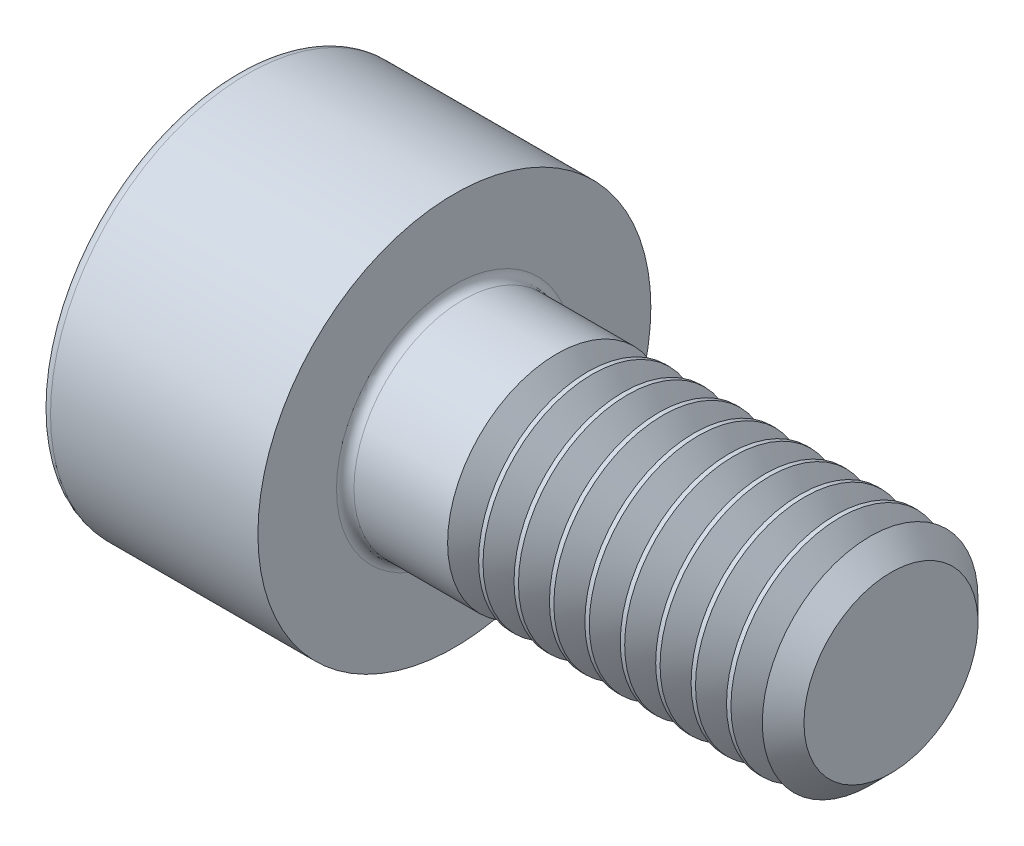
ISO-10303-21;
HEADER;
FILE_DESCRIPTION(('STEP AP214'),'2;1');
FILE_NAME('part.step','',(''),(''),'','','');
FILE_SCHEMA(('AUTOMOTIVE_DESIGN { 1 0 10303 214 1 1 1 1 }'));
ENDSEC;
DATA;
#1=APPLICATION_CONTEXT('core data for automotive mechanical design processes');
#2=APPLICATION_PROTOCOL_DEFINITION('international standard','automotive_design',2000,#1);
#3=PRODUCT_CONTEXT('',#1,'mechanical');
#4=PRODUCT('Part','Part','',(#3));
#5=PRODUCT_RELATED_PRODUCT_CATEGORY('part','',(#4));
#6=PRODUCT_DEFINITION_FORMATION('','',#4);
#7=PRODUCT_DEFINITION_CONTEXT('part definition',#1,'design');
#8=PRODUCT_DEFINITION('design','',#6,#7);
#9=PRODUCT_DEFINITION_SHAPE('','',#8);
#10=(LENGTH_UNIT() NAMED_UNIT(*) SI_UNIT(.MILLI.,.METRE.));
#11=(NAMED_UNIT(*) PLANE_ANGLE_UNIT() SI_UNIT($,.RADIAN.));
#12=(NAMED_UNIT(*) SI_UNIT($,.STERADIAN.) SOLID_ANGLE_UNIT());
#13=UNCERTAINTY_MEASURE_WITH_UNIT(LENGTH_MEASURE(1.E-05),#10,'distance_accuracy_value','');
#14=(GEOMETRIC_REPRESENTATION_CONTEXT(3) GLOBAL_UNCERTAINTY_ASSIGNED_CONTEXT((#13)) GLOBAL_UNIT_ASSIGNED_CONTEXT((#10,
#11,#12)) REPRESENTATION_CONTEXT('',''));
#15=CARTESIAN_POINT('',(0.,0.,0.));
#16=DIRECTION('',(0.,0.,1.));
#17=DIRECTION('',(1.,0.,0.));
#18=AXIS2_PLACEMENT_3D('',#15,#16,#17);
#19=CARTESIAN_POINT('',(0.,0.,1.94722710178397E-13));
#20=DIRECTION('',(-1.,0.,0.));
#21=DIRECTION('',(0.,0.,1.));
#22=AXIS2_PLACEMENT_3D('',#19,#20,#21);
#23=PLANE('',#22);
#24=DIRECTION('',(0.,-0.499999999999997,0.866025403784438));
#25=VECTOR('',#24,1.);
#26=CARTESIAN_POINT('',(0.,1.18068130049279,0.));
#27=LINE('',#26,#25);
#28=CARTESIAN_POINT('',(0.,1.18068130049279,0.));
#29=VERTEX_POINT('',#28);
#30=CARTESIAN_POINT('',(0.,0.59034065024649,1.02250000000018));
#31=VERTEX_POINT('',#30);
#32=EDGE_CURVE('E121',#29,#31,#27,.T.);
#33=ORIENTED_EDGE('',*,*,#32,.T.);
#34=DIRECTION('',(0.,0.999999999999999,0.));
#35=VECTOR('',#34,1.);
#36=CARTESIAN_POINT('',(-1.11022302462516E-13,-0.590340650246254,1.02250000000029));
#37=LINE('',#36,#35);
#38=CARTESIAN_POINT('',(-1.11022302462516E-13,-0.590340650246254,1.02250000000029));
#39=VERTEX_POINT('',#38);
#40=EDGE_CURVE('E110',#39,#31,#37,.T.);
#41=ORIENTED_EDGE('',*,*,#40,.F.);
#42=DIRECTION('',(0.,-0.500000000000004,-0.866025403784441));
#43=VECTOR('',#42,1.);
#44=CARTESIAN_POINT('',(-1.11022302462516E-13,-0.590340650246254,1.02250000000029));
#45=LINE('',#44,#43);
#46=CARTESIAN_POINT('',(0.,-1.1806813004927,3.6125616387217E-13));
#47=VERTEX_POINT('',#46);
#48=EDGE_CURVE('E120',#39,#47,#45,.T.);
#49=ORIENTED_EDGE('',*,*,#48,.T.);
#50=DIRECTION('',(0.,0.499999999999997,-0.866025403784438));
#51=VECTOR('',#50,1.);
#52=CARTESIAN_POINT('',(0.,-1.1806813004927,3.6125616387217E-13));
#53=LINE('',#52,#51);
#54=CARTESIAN_POINT('',(0.,-0.590340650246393,-1.02249999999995));
#55=VERTEX_POINT('',#54);
#56=EDGE_CURVE('E144',#47,#55,#53,.T.);
#57=ORIENTED_EDGE('',*,*,#56,.T.);
#58=DIRECTION('',(0.,-0.999999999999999,0.));
#59=VECTOR('',#58,1.);
#60=CARTESIAN_POINT('',(0.,0.590340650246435,-1.02249999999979));
#61=LINE('',#60,#59);
#62=CARTESIAN_POINT('',(0.,0.590340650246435,-1.02249999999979));
#63=VERTEX_POINT('',#62);
#64=EDGE_CURVE('E147',#63,#55,#61,.T.);
#65=ORIENTED_EDGE('',*,*,#64,.F.);
#66=DIRECTION('',(0.,-0.500000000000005,-0.866025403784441));
#67=VECTOR('',#66,1.);
#68=CARTESIAN_POINT('',(0.,1.18068130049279,0.));
#69=LINE('',#68,#67);
#70=EDGE_CURVE('E135',#29,#63,#69,.T.);
#71=ORIENTED_EDGE('',*,*,#70,.F.);
#72=EDGE_LOOP('',(#33,#41,#49,#57,#65,#71));
#73=FACE_BOUND('',#72,.T.);
#74=CARTESIAN_POINT('',(0.,0.,1.94722710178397E-13));
#75=DIRECTION('',(-1.,0.,0.));
#76=DIRECTION('',(0.,0.,1.));
#77=AXIS2_PLACEMENT_3D('',#74,#75,#76);
#78=CIRCLE('',#77,2.125);
#79=CARTESIAN_POINT('',(0.,0.,2.1250000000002));
#80=VERTEX_POINT('',#79);
#81=EDGE_CURVE('E46',#80,#80,#78,.T.);
#82=ORIENTED_EDGE('',*,*,#81,.T.);
#83=EDGE_LOOP('',(#82));
#84=FACE_BOUND('',#83,.T.);
#85=ADVANCED_FACE('F38',(#73,#84),#23,.T.);
#86=CARTESIAN_POINT('',(-31.7500000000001,0.,4.44089209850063E-13));
#87=DIRECTION('',(-1.,0.,0.));
#88=DIRECTION('',(0.,0.,1.));
#89=AXIS2_PLACEMENT_3D('',#86,#87,#88);
#90=CYLINDRICAL_SURFACE('',#89,2.25);
#91=CARTESIAN_POINT('',(0.124999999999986,1.11022302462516E-13,2.22478285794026E-13));
#92=DIRECTION('',(-1.,0.,0.));
#93=DIRECTION('',(0.,0.,1.));
#94=AXIS2_PLACEMENT_3D('',#91,#92,#93);
#95=CIRCLE('',#94,2.25);
#96=CARTESIAN_POINT('',(0.124999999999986,1.17403794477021E-13,2.25000000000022));
#97=VERTEX_POINT('',#96);
#98=EDGE_CURVE('E11',#97,#97,#95,.F.);
#99=ORIENTED_EDGE('',*,*,#98,.T.);
#100=EDGE_LOOP('',(#99));
#101=FACE_BOUND('',#100,.T.);
#102=CARTESIAN_POINT('',(2.50000000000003,0.,2.77555756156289E-13));
#103=DIRECTION('',(-1.,0.,0.));
#104=DIRECTION('',(0.,0.,1.));
#105=AXIS2_PLACEMENT_3D('',#102,#103,#104);
#106=CIRCLE('',#105,2.25);
#107=CARTESIAN_POINT('',(2.50000000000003,1.03526006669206E-13,2.25000000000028));
#108=VERTEX_POINT('',#107);
#109=EDGE_CURVE('E189',#108,#108,#106,.T.);
#110=ORIENTED_EDGE('',*,*,#109,.T.);
#111=EDGE_LOOP('',(#110));
#112=FACE_BOUND('',#111,.T.);
#113=ADVANCED_FACE('F217',(#101,#112),#90,.T.);
#114=CARTESIAN_POINT('',(2.49999999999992,2.25000000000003,0.));
#115=DIRECTION('',(1.,0.,0.));
#116=DIRECTION('',(0.,0.,-1.));
#117=AXIS2_PLACEMENT_3D('',#114,#115,#116);
#118=PLANE('',#117);
#119=CARTESIAN_POINT('',(2.50000000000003,0.,2.77555756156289E-13));
#120=DIRECTION('',(1.,0.,0.));
#121=DIRECTION('',(0.,0.,-1.));
#122=AXIS2_PLACEMENT_3D('',#119,#120,#121);
#123=CIRCLE('',#122,1.35);
#124=CARTESIAN_POINT('',(2.50000000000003,0.,-1.34999999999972));
#125=VERTEX_POINT('',#124);
#126=EDGE_CURVE('E192',#125,#125,#123,.F.);
#127=ORIENTED_EDGE('',*,*,#126,.T.);
#128=EDGE_LOOP('',(#127));
#129=FACE_BOUND('',#128,.T.);
#130=ORIENTED_EDGE('',*,*,#109,.F.);
#131=EDGE_LOOP('',(#130));
#132=FACE_BOUND('',#131,.T.);
#133=ADVANCED_FACE('F221',(#129,#132),#118,.T.);
#134=CARTESIAN_POINT('',(-31.7500000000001,0.,4.44089209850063E-13));
#135=DIRECTION('',(-1.,0.,0.));
#136=DIRECTION('',(0.,0.,1.));
#137=AXIS2_PLACEMENT_3D('',#134,#135,#136);
#138=CYLINDRICAL_SURFACE('',#137,1.25);
#139=CARTESIAN_POINT('',(3.67249738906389,1.52655665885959E-13,3.89011739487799E-13));
#140=DIRECTION('',(-1.,0.,0.));
#141=DIRECTION('',(0.,-0.999999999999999,0.));
#142=AXIS2_PLACEMENT_3D('',#139,#140,#141);
#143=CIRCLE('',#142,1.25);
#144=CARTESIAN_POINT('',(3.67249738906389,-1.24999999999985,3.84925991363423E-13));
#145=VERTEX_POINT('',#144);
#146=EDGE_CURVE('E139',#145,#145,#143,.T.);
#147=ORIENTED_EDGE('',*,*,#146,.T.);
#148=EDGE_LOOP('',(#147));
#149=FACE_BOUND('',#148,.T.);
#150=CARTESIAN_POINT('',(2.59999999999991,0.,4.9960036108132E-13));
#151=DIRECTION('',(1.,0.,0.));
#152=DIRECTION('',(0.,0.,-1.));
#153=AXIS2_PLACEMENT_3D('',#150,#151,#152);
#154=CIRCLE('',#153,1.25);
#155=CARTESIAN_POINT('',(2.59999999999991,0.,-1.2499999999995));
#156=VERTEX_POINT('',#155);
#157=EDGE_CURVE('E195',#156,#156,#154,.T.);
#158=ORIENTED_EDGE('',*,*,#157,.T.);
#159=EDGE_LOOP('',(#158));
#160=FACE_BOUND('',#159,.T.);
#161=ADVANCED_FACE('F211',(#149,#160),#138,.T.);
#162=CARTESIAN_POINT('',(2.59999999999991,0.,4.9960036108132E-13));
#163=DIRECTION('',(1.,0.,0.));
#164=DIRECTION('',(0.,0.,-1.));
#165=AXIS2_PLACEMENT_3D('',#162,#163,#164);
#166=TOROIDAL_SURFACE('',#165,1.35,0.1);
#167=ORIENTED_EDGE('',*,*,#157,.F.);
#168=EDGE_LOOP('',(#167));
#169=FACE_BOUND('',#168,.T.);
#170=ORIENTED_EDGE('',*,*,#126,.F.);
#171=EDGE_LOOP('',(#170));
#172=FACE_BOUND('',#171,.T.);
#173=ADVANCED_FACE('F203',(#169,#172),#166,.F.);
#174=CARTESIAN_POINT('',(0.124999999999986,1.11022302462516E-13,2.22478285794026E-13));
#175=DIRECTION('',(-1.,0.,0.));
#176=DIRECTION('',(0.,0.,1.));
#177=AXIS2_PLACEMENT_3D('',#174,#175,#176);
#178=TOROIDAL_SURFACE('',#177,2.125,0.125);
#179=ORIENTED_EDGE('',*,*,#98,.F.);
#180=EDGE_LOOP('',(#179));
#181=FACE_BOUND('',#180,.T.);
#182=ORIENTED_EDGE('',*,*,#81,.F.);
#183=EDGE_LOOP('',(#182));
#184=FACE_BOUND('',#183,.T.);
#185=ADVANCED_FACE('F201',(#181,#184),#178,.T.);
#186=CARTESIAN_POINT('',(1.09999999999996,1.18068130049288,1.1145598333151E-13));
#187=DIRECTION('',(0.,-0.866025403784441,-0.500000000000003));
#188=DIRECTION('',(0.,0.499999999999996,-0.866025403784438));
#189=AXIS2_PLACEMENT_3D('',#186,#187,#188);
#190=PLANE('',#189);
#191=ORIENTED_EDGE('',*,*,#32,.F.);
#192=DIRECTION('',(-1.,0.,0.));
#193=VECTOR('',#192,1.);
#194=CARTESIAN_POINT('',(1.09999999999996,1.18068130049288,1.1145598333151E-13));
#195=LINE('',#194,#193);
#196=CARTESIAN_POINT('',(1.09999999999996,1.18068130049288,1.1145598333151E-13));
#197=VERTEX_POINT('',#196);
#198=EDGE_CURVE('E170',#197,#29,#195,.T.);
#199=ORIENTED_EDGE('',*,*,#198,.F.);
#200=DIRECTION('',(0.,-0.499999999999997,0.866025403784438));
#201=VECTOR('',#200,1.);
#202=CARTESIAN_POINT('',(1.09999999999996,1.18068130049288,1.1145598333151E-13));
#203=LINE('',#202,#201);
#204=CARTESIAN_POINT('',(1.10000000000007,0.885510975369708,0.511250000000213));
#205=VERTEX_POINT('',#204);
#206=EDGE_CURVE('E150',#197,#205,#203,.T.);
#207=ORIENTED_EDGE('',*,*,#206,.T.);
#208=CARTESIAN_POINT('',(1.1000000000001,0.590340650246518,1.02250000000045));
#209=VERTEX_POINT('',#208);
#210=EDGE_CURVE('E129',#205,#209,#203,.T.);
#211=ORIENTED_EDGE('',*,*,#210,.T.);
#212=DIRECTION('',(-1.,0.,0.));
#213=VECTOR('',#212,1.);
#214=CARTESIAN_POINT('',(1.1000000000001,0.590340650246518,1.02250000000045));
#215=LINE('',#214,#213);
#216=EDGE_CURVE('E114',#209,#31,#215,.T.);
#217=ORIENTED_EDGE('',*,*,#216,.T.);
#218=EDGE_LOOP('',(#191,#199,#207,#211,#217));
#219=FACE_BOUND('',#218,.T.);
#220=ADVANCED_FACE('F125',(#219),#190,.T.);
#221=CARTESIAN_POINT('',(1.10000000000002,-0.590340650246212,1.02250000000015));
#222=DIRECTION('',(0.,0.,1.));
#223=DIRECTION('',(0.,-0.999999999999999,0.));
#224=AXIS2_PLACEMENT_3D('',#221,#222,#223);
#225=PLANE('',#224);
#226=ORIENTED_EDGE('',*,*,#40,.T.);
#227=ORIENTED_EDGE('',*,*,#216,.F.);
#228=DIRECTION('',(0.,0.999999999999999,0.));
#229=VECTOR('',#228,1.);
#230=CARTESIAN_POINT('',(1.10000000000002,-0.590340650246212,1.02250000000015));
#231=LINE('',#230,#229);
#232=CARTESIAN_POINT('',(1.09999999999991,0.,1.02250000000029));
#233=VERTEX_POINT('',#232);
#234=EDGE_CURVE('E152',#233,#209,#231,.T.);
#235=ORIENTED_EDGE('',*,*,#234,.F.);
#236=CARTESIAN_POINT('',(1.10000000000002,-0.590340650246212,1.02250000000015));
#237=VERTEX_POINT('',#236);
#238=EDGE_CURVE('E153',#237,#233,#231,.T.);
#239=ORIENTED_EDGE('',*,*,#238,.F.);
#240=DIRECTION('',(-1.,0.,0.));
#241=VECTOR('',#240,1.);
#242=CARTESIAN_POINT('',(1.10000000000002,-0.590340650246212,1.02250000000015));
#243=LINE('',#242,#241);
#244=EDGE_CURVE('E116',#237,#39,#243,.T.);
#245=ORIENTED_EDGE('',*,*,#244,.T.);
#246=EDGE_LOOP('',(#226,#227,#235,#239,#245));
#247=FACE_BOUND('',#246,.T.);
#248=ADVANCED_FACE('F112',(#247),#225,.F.);
#249=CARTESIAN_POINT('',(1.10000000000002,-0.590340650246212,1.02250000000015));
#250=DIRECTION('',(0.,0.866025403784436,-0.499999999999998));
#251=DIRECTION('',(0.,0.500000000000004,0.866025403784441));
#252=AXIS2_PLACEMENT_3D('',#249,#250,#251);
#253=PLANE('',#252);
#254=ORIENTED_EDGE('',*,*,#48,.F.);
#255=ORIENTED_EDGE('',*,*,#244,.F.);
#256=DIRECTION('',(0.,-0.500000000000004,-0.866025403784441));
#257=VECTOR('',#256,1.);
#258=CARTESIAN_POINT('',(1.10000000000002,-0.590340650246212,1.02250000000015));
#259=LINE('',#258,#257);
#260=CARTESIAN_POINT('',(1.09999999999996,-0.885510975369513,0.511250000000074));
#261=VERTEX_POINT('',#260);
#262=EDGE_CURVE('E157',#237,#261,#259,.T.);
#263=ORIENTED_EDGE('',*,*,#262,.T.);
#264=CARTESIAN_POINT('',(1.09999999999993,-1.18068130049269,3.04877650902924E-13));
#265=VERTEX_POINT('',#264);
#266=EDGE_CURVE('E156',#261,#265,#259,.T.);
#267=ORIENTED_EDGE('',*,*,#266,.T.);
#268=DIRECTION('',(-1.,0.,0.));
#269=VECTOR('',#268,1.);
#270=CARTESIAN_POINT('',(1.09999999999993,-1.18068130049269,3.04877650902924E-13));
#271=LINE('',#270,#269);
#272=EDGE_CURVE('E178',#265,#47,#271,.T.);
#273=ORIENTED_EDGE('',*,*,#272,.T.);
#274=EDGE_LOOP('',(#254,#255,#263,#267,#273));
#275=FACE_BOUND('',#274,.T.);
#276=ADVANCED_FACE('F347',(#275),#253,.T.);
#277=CARTESIAN_POINT('',(1.09999999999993,-1.18068130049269,3.04877650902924E-13));
#278=DIRECTION('',(0.,0.86602540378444,0.500000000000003));
#279=DIRECTION('',(0.,-0.499999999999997,0.866025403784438));
#280=AXIS2_PLACEMENT_3D('',#277,#278,#279);
#281=PLANE('',#280);
#282=ORIENTED_EDGE('',*,*,#56,.F.);
#283=ORIENTED_EDGE('',*,*,#272,.F.);
#284=DIRECTION('',(0.,0.499999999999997,-0.866025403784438));
#285=VECTOR('',#284,1.);
#286=CARTESIAN_POINT('',(1.09999999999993,-1.18068130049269,3.04877650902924E-13));
#287=LINE('',#286,#285);
#288=CARTESIAN_POINT('',(1.10000000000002,-0.885510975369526,-0.51124999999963));
#289=VERTEX_POINT('',#288);
#290=EDGE_CURVE('E161',#265,#289,#287,.T.);
#291=ORIENTED_EDGE('',*,*,#290,.T.);
#292=CARTESIAN_POINT('',(1.09999999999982,-0.590340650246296,-1.02249999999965));
#293=VERTEX_POINT('',#292);
#294=EDGE_CURVE('E160',#289,#293,#287,.T.);
#295=ORIENTED_EDGE('',*,*,#294,.T.);
#296=DIRECTION('',(-1.,0.,0.));
#297=VECTOR('',#296,1.);
#298=CARTESIAN_POINT('',(1.09999999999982,-0.590340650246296,-1.02249999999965));
#299=LINE('',#298,#297);
#300=EDGE_CURVE('E175',#293,#55,#299,.T.);
#301=ORIENTED_EDGE('',*,*,#300,.T.);
#302=EDGE_LOOP('',(#282,#283,#291,#295,#301));
#303=FACE_BOUND('',#302,.T.);
#304=ADVANCED_FACE('F343',(#303),#281,.T.);
#305=CARTESIAN_POINT('',(1.09999999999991,0.590340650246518,-1.02249999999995));
#306=DIRECTION('',(0.,0.,-1.));
#307=DIRECTION('',(0.,0.999999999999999,0.));
#308=AXIS2_PLACEMENT_3D('',#305,#306,#307);
#309=PLANE('',#308);
#310=ORIENTED_EDGE('',*,*,#64,.T.);
#311=ORIENTED_EDGE('',*,*,#300,.F.);
#312=DIRECTION('',(0.,-0.999999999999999,0.));
#313=VECTOR('',#312,1.);
#314=CARTESIAN_POINT('',(1.09999999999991,0.590340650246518,-1.02249999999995));
#315=LINE('',#314,#313);
#316=CARTESIAN_POINT('',(1.09999999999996,0.,-1.0224999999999));
#317=VERTEX_POINT('',#316);
#318=EDGE_CURVE('E164',#317,#293,#315,.T.);
#319=ORIENTED_EDGE('',*,*,#318,.F.);
#320=CARTESIAN_POINT('',(1.09999999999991,0.590340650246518,-1.02249999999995));
#321=VERTEX_POINT('',#320);
#322=EDGE_CURVE('E53',#321,#317,#315,.T.);
#323=ORIENTED_EDGE('',*,*,#322,.F.);
#324=DIRECTION('',(-1.,0.,0.));
#325=VECTOR('',#324,1.);
#326=CARTESIAN_POINT('',(1.09999999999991,0.590340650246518,-1.02249999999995));
#327=LINE('',#326,#325);
#328=EDGE_CURVE('E172',#321,#63,#327,.T.);
#329=ORIENTED_EDGE('',*,*,#328,.T.);
#330=EDGE_LOOP('',(#310,#311,#319,#323,#329));
#331=FACE_BOUND('',#330,.T.);
#332=ADVANCED_FACE('F339',(#331),#309,.F.);
#333=CARTESIAN_POINT('',(1.09999999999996,1.18068130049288,1.1145598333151E-13));
#334=DIRECTION('',(0.,0.866025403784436,-0.5));
#335=DIRECTION('',(0.,0.500000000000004,0.86602540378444));
#336=AXIS2_PLACEMENT_3D('',#333,#334,#335);
#337=PLANE('',#336);
#338=ORIENTED_EDGE('',*,*,#70,.T.);
#339=ORIENTED_EDGE('',*,*,#328,.F.);
#340=DIRECTION('',(0.,-0.500000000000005,-0.866025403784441));
#341=VECTOR('',#340,1.);
#342=CARTESIAN_POINT('',(1.09999999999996,1.18068130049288,1.1145598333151E-13));
#343=LINE('',#342,#341);
#344=CARTESIAN_POINT('',(1.10000000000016,0.885510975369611,-0.511249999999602));
#345=VERTEX_POINT('',#344);
#346=EDGE_CURVE('E166',#345,#321,#343,.T.);
#347=ORIENTED_EDGE('',*,*,#346,.F.);
#348=EDGE_CURVE('E167',#197,#345,#343,.T.);
#349=ORIENTED_EDGE('',*,*,#348,.F.);
#350=ORIENTED_EDGE('',*,*,#198,.T.);
#351=EDGE_LOOP('',(#338,#339,#347,#349,#350));
#352=FACE_BOUND('',#351,.T.);
#353=ADVANCED_FACE('F334',(#352),#337,.F.);
#354=CARTESIAN_POINT('',(1.09999999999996,1.18068130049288,1.1145598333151E-13));
#355=DIRECTION('',(1.,0.,0.));
#356=DIRECTION('',(0.,0.,-1.));
#357=AXIS2_PLACEMENT_3D('',#354,#355,#356);
#358=PLANE('',#357);
#359=ORIENTED_EDGE('',*,*,#318,.T.);
#360=ORIENTED_EDGE('',*,*,#294,.F.);
#361=CARTESIAN_POINT('',(1.09999999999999,0.,0.));
#362=DIRECTION('',(-1.,0.,0.));
#363=DIRECTION('',(0.,0.,1.));
#364=AXIS2_PLACEMENT_3D('',#361,#362,#363);
#365=CIRCLE('',#364,1.0225);
#366=EDGE_CURVE('E373',#317,#289,#365,.T.);
#367=ORIENTED_EDGE('',*,*,#366,.F.);
#368=EDGE_LOOP('',(#359,#360,#367));
#369=FACE_BOUND('',#368,.T.);
#370=ADVANCED_FACE('F330',(#369),#358,.F.);
#371=ORIENTED_EDGE('',*,*,#290,.F.);
#372=ORIENTED_EDGE('',*,*,#266,.F.);
#373=EDGE_CURVE('E371',#289,#261,#365,.T.);
#374=ORIENTED_EDGE('',*,*,#373,.F.);
#375=EDGE_LOOP('',(#371,#372,#374));
#376=FACE_BOUND('',#375,.T.);
#377=ADVANCED_FACE('F333',(#376),#358,.F.);
#378=ORIENTED_EDGE('',*,*,#262,.F.);
#379=ORIENTED_EDGE('',*,*,#238,.T.);
#380=EDGE_CURVE('E130',#261,#233,#365,.T.);
#381=ORIENTED_EDGE('',*,*,#380,.F.);
#382=EDGE_LOOP('',(#378,#379,#381));
#383=FACE_BOUND('',#382,.T.);
#384=ADVANCED_FACE('F367',(#383),#358,.F.);
#385=ORIENTED_EDGE('',*,*,#234,.T.);
#386=ORIENTED_EDGE('',*,*,#210,.F.);
#387=EDGE_CURVE('E182',#233,#205,#365,.T.);
#388=ORIENTED_EDGE('',*,*,#387,.F.);
#389=EDGE_LOOP('',(#385,#386,#388));
#390=FACE_BOUND('',#389,.T.);
#391=ADVANCED_FACE('F364',(#390),#358,.F.);
#392=ORIENTED_EDGE('',*,*,#206,.F.);
#393=ORIENTED_EDGE('',*,*,#348,.T.);
#394=EDGE_CURVE('E186',#205,#345,#365,.T.);
#395=ORIENTED_EDGE('',*,*,#394,.F.);
#396=EDGE_LOOP('',(#392,#393,#395));
#397=FACE_BOUND('',#396,.T.);
#398=ADVANCED_FACE('F357',(#397),#358,.F.);
#399=ORIENTED_EDGE('',*,*,#346,.T.);
#400=ORIENTED_EDGE('',*,*,#322,.T.);
#401=EDGE_CURVE('E377',#345,#317,#365,.T.);
#402=ORIENTED_EDGE('',*,*,#401,.F.);
#403=EDGE_LOOP('',(#399,#400,#402));
#404=FACE_BOUND('',#403,.T.);
#405=ADVANCED_FACE('F336',(#404),#358,.F.);
#406=CARTESIAN_POINT('',(1.09999999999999,0.,0.));
#407=DIRECTION('',(-1.,0.,0.));
#408=DIRECTION('',(0.,0.,1.));
#409=AXIS2_PLACEMENT_3D('',#406,#407,#408);
#410=CONICAL_SURFACE('',#409,1.0225,1.04719755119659);
#411=CARTESIAN_POINT('',(1.69034065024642,0.,1.94722710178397E-13));
#412=VERTEX_POINT('',#411);
#413=VERTEX_LOOP('',#412);
#414=FACE_BOUND('',#413,.T.);
#415=ORIENTED_EDGE('',*,*,#387,.T.);
#416=ORIENTED_EDGE('',*,*,#394,.T.);
#417=ORIENTED_EDGE('',*,*,#401,.T.);
#418=ORIENTED_EDGE('',*,*,#366,.T.);
#419=ORIENTED_EDGE('',*,*,#373,.T.);
#420=ORIENTED_EDGE('',*,*,#380,.T.);
#421=EDGE_LOOP('',(#415,#416,#417,#418,#419,#420));
#422=FACE_BOUND('',#421,.T.);
#423=ADVANCED_FACE('F328',(#414,#422),#410,.F.);
#424=CARTESIAN_POINT('',(4.02750261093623,0.,0.));
#425=DIRECTION('',(1.,0.,0.));
#426=DIRECTION('',(0.,0.999999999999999,0.));
#427=AXIS2_PLACEMENT_3D('',#424,#425,#426);
#428=CONICAL_SURFACE('',#427,1.25,0.959931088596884);
#429=CARTESIAN_POINT('',(3.84999999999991,0.,4.72278466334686E-13));
#430=DIRECTION('',(-1.,0.,0.));
#431=DIRECTION('',(0.,-0.999999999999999,0.));
#432=AXIS2_PLACEMENT_3D('',#429,#430,#431);
#433=CIRCLE('',#432,0.996500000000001);
#434=CARTESIAN_POINT('',(3.84999999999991,-0.996499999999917,4.69021307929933E-13));
#435=VERTEX_POINT('',#434);
#436=EDGE_CURVE('E743',#435,#435,#433,.T.);
#437=ORIENTED_EDGE('',*,*,#436,.F.);
#438=EDGE_LOOP('',(#437));
#439=FACE_BOUND('',#438,.T.);
#440=CARTESIAN_POINT('',(4.02750261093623,0.,0.));
#441=DIRECTION('',(-1.,0.,0.));
#442=DIRECTION('',(0.,-0.999999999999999,0.));
#443=AXIS2_PLACEMENT_3D('',#440,#441,#442);
#444=CIRCLE('',#443,1.25);
#445=CARTESIAN_POINT('',(4.02750261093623,-1.24999999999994,0.));
#446=VERTEX_POINT('',#445);
#447=EDGE_CURVE('E136',#446,#446,#444,.T.);
#448=ORIENTED_EDGE('',*,*,#447,.T.);
#449=EDGE_LOOP('',(#448));
#450=FACE_BOUND('',#449,.T.);
#451=ADVANCED_FACE('F324',(#439,#450),#428,.T.);
#452=CARTESIAN_POINT('',(3.84999999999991,0.,4.72278466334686E-13));
#453=DIRECTION('',(-1.,0.,0.));
#454=DIRECTION('',(0.,-0.999999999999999,0.));
#455=AXIS2_PLACEMENT_3D('',#452,#453,#454);
#456=CONICAL_SURFACE('',#455,0.996500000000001,0.959931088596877);
#457=ORIENTED_EDGE('',*,*,#146,.F.);
#458=EDGE_LOOP('',(#457));
#459=FACE_BOUND('',#458,.T.);
#460=ORIENTED_EDGE('',*,*,#436,.T.);
#461=EDGE_LOOP('',(#460));
#462=FACE_BOUND('',#461,.T.);
#463=ADVANCED_FACE('F321',(#459,#462),#456,.T.);
#464=CARTESIAN_POINT('',(4.07805294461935,1.94289029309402E-13,3.60822483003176E-13));
#465=DIRECTION('',(-1.,0.,0.));
#466=DIRECTION('',(0.,-0.999999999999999,0.));
#467=AXIS2_PLACEMENT_3D('',#464,#465,#466);
#468=CIRCLE('',#467,1.25);
#469=CARTESIAN_POINT('',(4.07805294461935,-1.24999999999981,3.567367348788E-13));
#470=VERTEX_POINT('',#469);
#471=EDGE_CURVE('E737',#470,#470,#468,.T.);
#472=ORIENTED_EDGE('',*,*,#471,.T.);
#473=EDGE_LOOP('',(#472));
#474=FACE_BOUND('',#473,.T.);
#475=ORIENTED_EDGE('',*,*,#447,.F.);
#476=EDGE_LOOP('',(#475));
#477=FACE_BOUND('',#476,.T.);
#478=ADVANCED_FACE('F234',(#474,#477),#138,.T.);
#479=CARTESIAN_POINT('',(4.43305816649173,1.81278603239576E-13,2.22478285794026E-13));
#480=DIRECTION('',(1.,0.,0.));
#481=DIRECTION('',(0.,0.999999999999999,0.));
#482=AXIS2_PLACEMENT_3D('',#479,#480,#481);
#483=CONICAL_SURFACE('',#482,1.25,0.959931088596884);
#484=CARTESIAN_POINT('',(4.25555555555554,1.2490009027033E-13,3.05311331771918E-13));
#485=DIRECTION('',(-1.,0.,0.));
#486=DIRECTION('',(0.,-0.999999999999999,0.));
#487=AXIS2_PLACEMENT_3D('',#484,#485,#486);
#488=CIRCLE('',#487,0.996500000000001);
#489=CARTESIAN_POINT('',(4.25555555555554,-0.996499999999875,3.02054173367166E-13));
#490=VERTEX_POINT('',#489);
#491=EDGE_CURVE('E734',#490,#490,#488,.T.);
#492=ORIENTED_EDGE('',*,*,#491,.F.);
#493=EDGE_LOOP('',(#492));
#494=FACE_BOUND('',#493,.T.);
#495=CARTESIAN_POINT('',(4.43305816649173,1.81278603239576E-13,2.22478285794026E-13));
#496=DIRECTION('',(-1.,0.,0.));
#497=DIRECTION('',(0.,-0.999999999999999,0.));
#498=AXIS2_PLACEMENT_3D('',#495,#496,#497);
#499=CIRCLE('',#498,1.25);
#500=CARTESIAN_POINT('',(4.43305816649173,-1.24999999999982,2.1839253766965E-13));
#501=VERTEX_POINT('',#500);
#502=EDGE_CURVE('E740',#501,#501,#499,.T.);
#503=ORIENTED_EDGE('',*,*,#502,.T.);
#504=EDGE_LOOP('',(#503));
#505=FACE_BOUND('',#504,.T.);
#506=ADVANCED_FACE('F316',(#494,#505),#483,.T.);
#507=CARTESIAN_POINT('',(4.25555555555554,1.2490009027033E-13,3.05311331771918E-13));
#508=DIRECTION('',(-1.,0.,0.));
#509=DIRECTION('',(0.,-0.999999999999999,0.));
#510=AXIS2_PLACEMENT_3D('',#507,#508,#509);
#511=CONICAL_SURFACE('',#510,0.996500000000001,0.959931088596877);
#512=ORIENTED_EDGE('',*,*,#471,.F.);
#513=EDGE_LOOP('',(#512));
#514=FACE_BOUND('',#513,.T.);
#515=ORIENTED_EDGE('',*,*,#491,.T.);
#516=EDGE_LOOP('',(#515));
#517=FACE_BOUND('',#516,.T.);
#518=ADVANCED_FACE('F313',(#514,#517),#511,.T.);
#519=CARTESIAN_POINT('',(4.48360850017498,0.,1.66967134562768E-13));
#520=DIRECTION('',(-1.,0.,0.));
#521=DIRECTION('',(0.,-0.999999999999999,0.));
#522=AXIS2_PLACEMENT_3D('',#519,#520,#521);
#523=CIRCLE('',#522,1.25);
#524=CARTESIAN_POINT('',(4.48360850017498,-1.24999999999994,1.62881386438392E-13));
#525=VERTEX_POINT('',#524);
#526=EDGE_CURVE('E728',#525,#525,#523,.T.);
#527=ORIENTED_EDGE('',*,*,#526,.T.);
#528=EDGE_LOOP('',(#527));
#529=FACE_BOUND('',#528,.T.);
#530=ORIENTED_EDGE('',*,*,#502,.F.);
#531=EDGE_LOOP('',(#530));
#532=FACE_BOUND('',#531,.T.);
#533=ADVANCED_FACE('F311',(#529,#532),#138,.T.);
#534=CARTESIAN_POINT('',(4.83861372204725,0.,4.72278466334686E-13));
#535=DIRECTION('',(1.,0.,0.));
#536=DIRECTION('',(0.,0.999999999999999,0.));
#537=AXIS2_PLACEMENT_3D('',#534,#535,#536);
#538=CONICAL_SURFACE('',#537,1.25,0.959931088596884);
#539=CARTESIAN_POINT('',(4.66111111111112,1.2490009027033E-13,3.88578058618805E-13));
#540=DIRECTION('',(-1.,0.,0.));
#541=DIRECTION('',(0.,-0.999999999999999,0.));
#542=AXIS2_PLACEMENT_3D('',#539,#540,#541);
#543=CIRCLE('',#542,0.996500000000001);
#544=CARTESIAN_POINT('',(4.66111111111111,-0.996499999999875,3.85320900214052E-13));
#545=VERTEX_POINT('',#544);
#546=EDGE_CURVE('E725',#545,#545,#543,.T.);
#547=ORIENTED_EDGE('',*,*,#546,.F.);
#548=EDGE_LOOP('',(#547));
#549=FACE_BOUND('',#548,.T.);
#550=CARTESIAN_POINT('',(4.83861372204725,0.,4.72278466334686E-13));
#551=DIRECTION('',(-1.,0.,0.));
#552=DIRECTION('',(0.,-0.999999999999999,0.));
#553=AXIS2_PLACEMENT_3D('',#550,#551,#552);
#554=CIRCLE('',#553,1.25);
#555=CARTESIAN_POINT('',(4.83861372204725,-1.2499999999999,4.6819271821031E-13));
#556=VERTEX_POINT('',#555);
#557=EDGE_CURVE('E731',#556,#556,#554,.T.);
#558=ORIENTED_EDGE('',*,*,#557,.T.);
#559=EDGE_LOOP('',(#558));
#560=FACE_BOUND('',#559,.T.);
#561=ADVANCED_FACE('F307',(#549,#560),#538,.T.);
#562=CARTESIAN_POINT('',(4.66111111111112,1.2490009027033E-13,3.88578058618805E-13));
#563=DIRECTION('',(-1.,0.,0.));
#564=DIRECTION('',(0.,-0.999999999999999,0.));
#565=AXIS2_PLACEMENT_3D('',#562,#563,#564);
#566=CONICAL_SURFACE('',#565,0.996500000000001,0.959931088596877);
#567=ORIENTED_EDGE('',*,*,#526,.F.);
#568=EDGE_LOOP('',(#567));
#569=FACE_BOUND('',#568,.T.);
#570=ORIENTED_EDGE('',*,*,#546,.T.);
#571=EDGE_LOOP('',(#570));
#572=FACE_BOUND('',#571,.T.);
#573=ADVANCED_FACE('F304',(#569,#572),#566,.T.);
#574=CARTESIAN_POINT('',(4.88916405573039,0.,5.82867087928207E-13));
#575=DIRECTION('',(-1.,0.,0.));
#576=DIRECTION('',(0.,-0.999999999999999,0.));
#577=AXIS2_PLACEMENT_3D('',#574,#575,#576);
#578=CIRCLE('',#577,1.25);
#579=CARTESIAN_POINT('',(4.88916405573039,-1.24999999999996,5.78781339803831E-13));
#580=VERTEX_POINT('',#579);
#581=EDGE_CURVE('E719',#580,#580,#578,.T.);
#582=ORIENTED_EDGE('',*,*,#581,.T.);
#583=EDGE_LOOP('',(#582));
#584=FACE_BOUND('',#583,.T.);
#585=ORIENTED_EDGE('',*,*,#557,.F.);
#586=EDGE_LOOP('',(#585));
#587=FACE_BOUND('',#586,.T.);
#588=ADVANCED_FACE('F302',(#584,#587),#138,.T.);
#589=CARTESIAN_POINT('',(5.24416927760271,1.38777878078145E-13,3.60822483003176E-13));
#590=DIRECTION('',(1.,0.,0.));
#591=DIRECTION('',(0.,0.999999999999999,0.));
#592=AXIS2_PLACEMENT_3D('',#589,#590,#591);
#593=CONICAL_SURFACE('',#592,1.25,0.959931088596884);
#594=CARTESIAN_POINT('',(5.06666666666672,0.,3.6125616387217E-13));
#595=DIRECTION('',(-1.,0.,0.));
#596=DIRECTION('',(0.,-0.999999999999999,0.));
#597=AXIS2_PLACEMENT_3D('',#594,#595,#596);
#598=CIRCLE('',#597,0.996500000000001);
#599=CARTESIAN_POINT('',(5.06666666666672,-0.996499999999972,3.57999005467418E-13));
#600=VERTEX_POINT('',#599);
#601=EDGE_CURVE('E716',#600,#600,#598,.T.);
#602=ORIENTED_EDGE('',*,*,#601,.F.);
#603=EDGE_LOOP('',(#602));
#604=FACE_BOUND('',#603,.T.);
#605=CARTESIAN_POINT('',(5.24416927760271,1.38777878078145E-13,3.60822483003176E-13));
#606=DIRECTION('',(-1.,0.,0.));
#607=DIRECTION('',(0.,-0.999999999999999,0.));
#608=AXIS2_PLACEMENT_3D('',#605,#606,#607);
#609=CIRCLE('',#608,1.25);
#610=CARTESIAN_POINT('',(5.24416927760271,-1.24999999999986,3.567367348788E-13));
#611=VERTEX_POINT('',#610);
#612=EDGE_CURVE('E722',#611,#611,#609,.T.);
#613=ORIENTED_EDGE('',*,*,#612,.T.);
#614=EDGE_LOOP('',(#613));
#615=FACE_BOUND('',#614,.T.);
#616=ADVANCED_FACE('F298',(#604,#615),#593,.T.);
#617=CARTESIAN_POINT('',(5.06666666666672,0.,3.6125616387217E-13));
#618=DIRECTION('',(-1.,0.,0.));
#619=DIRECTION('',(0.,-0.999999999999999,0.));
#620=AXIS2_PLACEMENT_3D('',#617,#618,#619);
#621=CONICAL_SURFACE('',#620,0.996500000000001,0.959931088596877);
#622=ORIENTED_EDGE('',*,*,#581,.F.);
#623=EDGE_LOOP('',(#622));
#624=FACE_BOUND('',#623,.T.);
#625=ORIENTED_EDGE('',*,*,#601,.T.);
#626=EDGE_LOOP('',(#625));
#627=FACE_BOUND('',#626,.T.);
#628=ADVANCED_FACE('F295',(#624,#627),#621,.T.);
#629=CARTESIAN_POINT('',(5.29471961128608,1.95156391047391E-13,2.77989437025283E-13));
#630=DIRECTION('',(-1.,0.,0.));
#631=DIRECTION('',(0.,-0.999999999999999,0.));
#632=AXIS2_PLACEMENT_3D('',#629,#630,#631);
#633=CIRCLE('',#632,1.25);
#634=CARTESIAN_POINT('',(5.29471961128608,-1.2499999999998,2.73903688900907E-13));
#635=VERTEX_POINT('',#634);
#636=EDGE_CURVE('E710',#635,#635,#633,.T.);
#637=ORIENTED_EDGE('',*,*,#636,.T.);
#638=EDGE_LOOP('',(#637));
#639=FACE_BOUND('',#638,.T.);
#640=ORIENTED_EDGE('',*,*,#612,.F.);
#641=EDGE_LOOP('',(#640));
#642=FACE_BOUND('',#641,.T.);
#643=ADVANCED_FACE('F293',(#639,#642),#138,.T.);
#644=CARTESIAN_POINT('',(5.64972483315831,1.38777878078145E-13,2.77555756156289E-13));
#645=DIRECTION('',(1.,0.,0.));
#646=DIRECTION('',(0.,0.999999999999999,0.));
#647=AXIS2_PLACEMENT_3D('',#644,#645,#646);
#648=CONICAL_SURFACE('',#647,1.25,0.959931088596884);
#649=CARTESIAN_POINT('',(5.4722222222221,1.11022302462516E-13,4.44089209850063E-13));
#650=DIRECTION('',(-1.,0.,0.));
#651=DIRECTION('',(0.,-0.999999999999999,0.));
#652=AXIS2_PLACEMENT_3D('',#649,#650,#651);
#653=CIRCLE('',#652,0.996500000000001);
#654=CARTESIAN_POINT('',(5.4722222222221,-0.996499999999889,4.4083205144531E-13));
#655=VERTEX_POINT('',#654);
#656=EDGE_CURVE('E707',#655,#655,#653,.T.);
#657=ORIENTED_EDGE('',*,*,#656,.F.);
#658=EDGE_LOOP('',(#657));
#659=FACE_BOUND('',#658,.T.);
#660=CARTESIAN_POINT('',(5.64972483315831,1.38777878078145E-13,2.77555756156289E-13));
#661=DIRECTION('',(-1.,0.,0.));
#662=DIRECTION('',(0.,-0.999999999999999,0.));
#663=AXIS2_PLACEMENT_3D('',#660,#661,#662);
#664=CIRCLE('',#663,1.25);
#665=CARTESIAN_POINT('',(5.64972483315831,-1.24999999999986,2.73470008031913E-13));
#666=VERTEX_POINT('',#665);
#667=EDGE_CURVE('E713',#666,#666,#664,.T.);
#668=ORIENTED_EDGE('',*,*,#667,.T.);
#669=EDGE_LOOP('',(#668));
#670=FACE_BOUND('',#669,.T.);
#671=ADVANCED_FACE('F289',(#659,#670),#648,.T.);
#672=CARTESIAN_POINT('',(5.4722222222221,1.11022302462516E-13,4.44089209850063E-13));
#673=DIRECTION('',(-1.,0.,0.));
#674=DIRECTION('',(0.,-0.999999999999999,0.));
#675=AXIS2_PLACEMENT_3D('',#672,#673,#674);
#676=CONICAL_SURFACE('',#675,0.996500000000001,0.959931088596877);
#677=ORIENTED_EDGE('',*,*,#636,.F.);
#678=EDGE_LOOP('',(#677));
#679=FACE_BOUND('',#678,.T.);
#680=ORIENTED_EDGE('',*,*,#656,.T.);
#681=EDGE_LOOP('',(#680));
#682=FACE_BOUND('',#681,.T.);
#683=ADVANCED_FACE('F286',(#679,#682),#676,.T.);
#684=CARTESIAN_POINT('',(5.7002751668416,1.52655665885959E-13,1.38777878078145E-13));
#685=DIRECTION('',(-1.,0.,0.));
#686=DIRECTION('',(0.,-0.999999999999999,0.));
#687=AXIS2_PLACEMENT_3D('',#684,#685,#686);
#688=CIRCLE('',#687,1.25);
#689=CARTESIAN_POINT('',(5.7002751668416,-1.24999999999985,1.34692129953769E-13));
#690=VERTEX_POINT('',#689);
#691=EDGE_CURVE('E701',#690,#690,#688,.T.);
#692=ORIENTED_EDGE('',*,*,#691,.T.);
#693=EDGE_LOOP('',(#692));
#694=FACE_BOUND('',#693,.T.);
#695=ORIENTED_EDGE('',*,*,#667,.F.);
#696=EDGE_LOOP('',(#695));
#697=FACE_BOUND('',#696,.T.);
#698=ADVANCED_FACE('F284',(#694,#697),#138,.T.);
#699=CARTESIAN_POINT('',(6.05528038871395,1.38777878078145E-13,0.));
#700=DIRECTION('',(1.,0.,0.));
#701=DIRECTION('',(0.,0.999999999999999,0.));
#702=AXIS2_PLACEMENT_3D('',#699,#700,#701);
#703=CONICAL_SURFACE('',#702,1.25,0.959931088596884);
#704=CARTESIAN_POINT('',(5.87777777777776,1.52655665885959E-13,4.16333634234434E-13));
#705=DIRECTION('',(-1.,0.,0.));
#706=DIRECTION('',(0.,-0.999999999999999,0.));
#707=AXIS2_PLACEMENT_3D('',#704,#705,#706);
#708=CIRCLE('',#707,0.996500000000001);
#709=CARTESIAN_POINT('',(5.87777777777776,-0.996499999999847,4.13076475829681E-13));
#710=VERTEX_POINT('',#709);
#711=EDGE_CURVE('E698',#710,#710,#708,.T.);
#712=ORIENTED_EDGE('',*,*,#711,.F.);
#713=EDGE_LOOP('',(#712));
#714=FACE_BOUND('',#713,.T.);
#715=CARTESIAN_POINT('',(6.05528038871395,1.38777878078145E-13,0.));
#716=DIRECTION('',(-1.,0.,0.));
#717=DIRECTION('',(0.,-0.999999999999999,0.));
#718=AXIS2_PLACEMENT_3D('',#715,#716,#717);
#719=CIRCLE('',#718,1.25);
#720=CARTESIAN_POINT('',(6.05528038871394,-1.24999999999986,0.));
#721=VERTEX_POINT('',#720);
#722=EDGE_CURVE('E704',#721,#721,#719,.T.);
#723=ORIENTED_EDGE('',*,*,#722,.T.);
#724=EDGE_LOOP('',(#723));
#725=FACE_BOUND('',#724,.T.);
#726=ADVANCED_FACE('F280',(#714,#725),#703,.T.);
#727=CARTESIAN_POINT('',(5.87777777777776,1.52655665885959E-13,4.16333634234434E-13));
#728=DIRECTION('',(-1.,0.,0.));
#729=DIRECTION('',(0.,-0.999999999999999,0.));
#730=AXIS2_PLACEMENT_3D('',#727,#728,#729);
#731=CONICAL_SURFACE('',#730,0.996500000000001,0.959931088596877);
#732=ORIENTED_EDGE('',*,*,#691,.F.);
#733=EDGE_LOOP('',(#732));
#734=FACE_BOUND('',#733,.T.);
#735=ORIENTED_EDGE('',*,*,#711,.T.);
#736=EDGE_LOOP('',(#735));
#737=FACE_BOUND('',#736,.T.);
#738=ADVANCED_FACE('F277',(#734,#737),#731,.T.);
#739=CARTESIAN_POINT('',(6.10583072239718,0.,2.22044604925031E-13));
#740=DIRECTION('',(-1.,0.,0.));
#741=DIRECTION('',(0.,-0.999999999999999,0.));
#742=AXIS2_PLACEMENT_3D('',#739,#740,#741);
#743=CIRCLE('',#742,1.25);
#744=CARTESIAN_POINT('',(6.10583072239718,-1.24999999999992,2.17958856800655E-13));
#745=VERTEX_POINT('',#744);
#746=EDGE_CURVE('E686',#745,#745,#743,.T.);
#747=ORIENTED_EDGE('',*,*,#746,.T.);
#748=EDGE_LOOP('',(#747));
#749=FACE_BOUND('',#748,.T.);
#750=ORIENTED_EDGE('',*,*,#722,.F.);
#751=EDGE_LOOP('',(#750));
#752=FACE_BOUND('',#751,.T.);
#753=ADVANCED_FACE('F275',(#749,#752),#138,.T.);
#754=CARTESIAN_POINT('',(6.46083594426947,1.52655665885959E-13,0.));
#755=DIRECTION('',(1.,0.,0.));
#756=DIRECTION('',(0.,0.999999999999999,0.));
#757=AXIS2_PLACEMENT_3D('',#754,#755,#756);
#758=CONICAL_SURFACE('',#757,1.25,0.959931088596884);
#759=CARTESIAN_POINT('',(6.28333333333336,1.66533453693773E-13,3.33500588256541E-13));
#760=DIRECTION('',(-1.,0.,0.));
#761=DIRECTION('',(0.,-0.999999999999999,0.));
#762=AXIS2_PLACEMENT_3D('',#759,#760,#761);
#763=CIRCLE('',#762,0.996500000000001);
#764=CARTESIAN_POINT('',(6.28333333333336,-0.996499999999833,3.30243429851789E-13));
#765=VERTEX_POINT('',#764);
#766=EDGE_CURVE('E682',#765,#765,#763,.T.);
#767=ORIENTED_EDGE('',*,*,#766,.F.);
#768=EDGE_LOOP('',(#767));
#769=FACE_BOUND('',#768,.T.);
#770=CARTESIAN_POINT('',(6.46083594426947,1.52655665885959E-13,0.));
#771=DIRECTION('',(-1.,0.,0.));
#772=DIRECTION('',(0.,-0.999999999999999,0.));
#773=AXIS2_PLACEMENT_3D('',#770,#771,#772);
#774=CIRCLE('',#773,1.25);
#775=CARTESIAN_POINT('',(6.46083594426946,-1.24999999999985,0.));
#776=VERTEX_POINT('',#775);
#777=EDGE_CURVE('E695',#776,#776,#774,.T.);
#778=ORIENTED_EDGE('',*,*,#777,.T.);
#779=EDGE_LOOP('',(#778));
#780=FACE_BOUND('',#779,.T.);
#781=ADVANCED_FACE('F271',(#769,#780),#758,.T.);
#782=CARTESIAN_POINT('',(6.28333333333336,1.66533453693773E-13,3.33500588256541E-13));
#783=DIRECTION('',(-1.,0.,0.));
#784=DIRECTION('',(0.,-0.999999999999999,0.));
#785=AXIS2_PLACEMENT_3D('',#782,#783,#784);
#786=CONICAL_SURFACE('',#785,0.996500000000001,0.959931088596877);
#787=ORIENTED_EDGE('',*,*,#746,.F.);
#788=EDGE_LOOP('',(#787));
#789=FACE_BOUND('',#788,.T.);
#790=ORIENTED_EDGE('',*,*,#766,.T.);
#791=EDGE_LOOP('',(#790));
#792=FACE_BOUND('',#791,.T.);
#793=ADVANCED_FACE('F268',(#789,#792),#786,.T.);
#794=CARTESIAN_POINT('',(6.51138627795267,0.,2.4980018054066E-13));
#795=DIRECTION('',(-1.,0.,0.));
#796=DIRECTION('',(0.,-0.999999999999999,0.));
#797=AXIS2_PLACEMENT_3D('',#794,#795,#796);
#798=CIRCLE('',#797,1.25);
#799=CARTESIAN_POINT('',(6.51138627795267,-1.2499999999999,2.45714432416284E-13));
#800=VERTEX_POINT('',#799);
#801=EDGE_CURVE('E683',#800,#800,#798,.T.);
#802=ORIENTED_EDGE('',*,*,#801,.T.);
#803=EDGE_LOOP('',(#802));
#804=FACE_BOUND('',#803,.T.);
#805=ORIENTED_EDGE('',*,*,#777,.F.);
#806=EDGE_LOOP('',(#805));
#807=FACE_BOUND('',#806,.T.);
#808=ADVANCED_FACE('F266',(#804,#807),#138,.T.);
#809=CARTESIAN_POINT('',(6.86639149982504,0.,-1.1145598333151E-13));
#810=DIRECTION('',(1.,0.,0.));
#811=DIRECTION('',(0.,0.999999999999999,0.));
#812=AXIS2_PLACEMENT_3D('',#809,#810,#811);
#813=CONICAL_SURFACE('',#812,1.25,0.959931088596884);
#814=CARTESIAN_POINT('',(6.68888888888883,0.,2.77555756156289E-13));
#815=DIRECTION('',(-1.,0.,0.));
#816=DIRECTION('',(0.,-0.999999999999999,0.));
#817=AXIS2_PLACEMENT_3D('',#814,#815,#816);
#818=CIRCLE('',#817,0.996500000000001);
#819=CARTESIAN_POINT('',(6.68888888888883,-0.996499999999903,2.74298597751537E-13));
#820=VERTEX_POINT('',#819);
#821=EDGE_CURVE('E689',#820,#820,#818,.T.);
#822=ORIENTED_EDGE('',*,*,#821,.F.);
#823=EDGE_LOOP('',(#822));
#824=FACE_BOUND('',#823,.T.);
#825=CARTESIAN_POINT('',(6.86639149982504,0.,-1.1145598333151E-13));
#826=DIRECTION('',(-1.,0.,0.));
#827=DIRECTION('',(0.,-0.999999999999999,0.));
#828=AXIS2_PLACEMENT_3D('',#825,#826,#827);
#829=CIRCLE('',#828,1.25);
#830=CARTESIAN_POINT('',(6.86639149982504,-1.2499999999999,-1.15541731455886E-13));
#831=VERTEX_POINT('',#830);
#832=EDGE_CURVE('E680',#831,#831,#829,.T.);
#833=ORIENTED_EDGE('',*,*,#832,.T.);
#834=EDGE_LOOP('',(#833));
#835=FACE_BOUND('',#834,.T.);
#836=ADVANCED_FACE('F262',(#824,#835),#813,.T.);
#837=CARTESIAN_POINT('',(6.68888888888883,0.,2.77555756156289E-13));
#838=DIRECTION('',(-1.,0.,0.));
#839=DIRECTION('',(0.,-0.999999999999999,0.));
#840=AXIS2_PLACEMENT_3D('',#837,#838,#839);
#841=CONICAL_SURFACE('',#840,0.996500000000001,0.959931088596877);
#842=ORIENTED_EDGE('',*,*,#801,.F.);
#843=EDGE_LOOP('',(#842));
#844=FACE_BOUND('',#843,.T.);
#845=ORIENTED_EDGE('',*,*,#821,.T.);
#846=EDGE_LOOP('',(#845));
#847=FACE_BOUND('',#846,.T.);
#848=ADVANCED_FACE('F259',(#844,#847),#841,.T.);
#849=CARTESIAN_POINT('',(6.91694183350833,1.80411241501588E-13,3.60822483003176E-13));
#850=DIRECTION('',(-1.,0.,0.));
#851=DIRECTION('',(0.,-0.999999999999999,0.));
#852=AXIS2_PLACEMENT_3D('',#849,#850,#851);
#853=CIRCLE('',#852,1.25);
#854=CARTESIAN_POINT('',(6.91694183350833,-1.24999999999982,3.567367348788E-13));
#855=VERTEX_POINT('',#854);
#856=EDGE_CURVE('E677',#855,#855,#853,.T.);
#857=ORIENTED_EDGE('',*,*,#856,.T.);
#858=EDGE_LOOP('',(#857));
#859=FACE_BOUND('',#858,.T.);
#860=ORIENTED_EDGE('',*,*,#832,.F.);
#861=EDGE_LOOP('',(#860));
#862=FACE_BOUND('',#861,.T.);
#863=ADVANCED_FACE('F233',(#859,#862),#138,.T.);
#864=CARTESIAN_POINT('',(7.27194705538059,0.,1.94289029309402E-13));
#865=DIRECTION('',(1.,0.,0.));
#866=DIRECTION('',(0.,0.999999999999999,0.));
#867=AXIS2_PLACEMENT_3D('',#864,#865,#866);
#868=CONICAL_SURFACE('',#867,1.25,0.959931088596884);
#869=CARTESIAN_POINT('',(7.09444444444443,1.2490009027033E-13,4.16333634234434E-13));
#870=DIRECTION('',(-1.,0.,0.));
#871=DIRECTION('',(0.,-0.999999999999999,0.));
#872=AXIS2_PLACEMENT_3D('',#869,#870,#871);
#873=CIRCLE('',#872,0.996500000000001);
#874=CARTESIAN_POINT('',(7.09444444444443,-0.996499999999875,4.13076475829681E-13));
#875=VERTEX_POINT('',#874);
#876=EDGE_CURVE('E797',#875,#875,#873,.T.);
#877=ORIENTED_EDGE('',*,*,#876,.F.);
#878=EDGE_LOOP('',(#877));
#879=FACE_BOUND('',#878,.T.);
#880=CARTESIAN_POINT('',(7.26146702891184,1.2490009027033E-13,0.));
#881=DIRECTION('',(1.,0.,0.));
#882=DIRECTION('',(0.,0.999999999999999,0.));
#883=AXIS2_PLACEMENT_3D('',#880,#881,#882);
#884=CIRCLE('',#883,1.2350329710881);
#885=CARTESIAN_POINT('',(7.26146702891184,1.23503297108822,0.));
#886=VERTEX_POINT('',#885);
#887=EDGE_CURVE('E41',#886,#886,#884,.T.);
#888=ORIENTED_EDGE('',*,*,#887,.F.);
#889=EDGE_LOOP('',(#888));
#890=FACE_BOUND('',#889,.T.);
#891=ADVANCED_FACE('F246',(#879,#890),#868,.T.);
#892=CARTESIAN_POINT('',(7.09444444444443,1.2490009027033E-13,4.16333634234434E-13));
#893=DIRECTION('',(-1.,0.,0.));
#894=DIRECTION('',(0.,-0.999999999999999,0.));
#895=AXIS2_PLACEMENT_3D('',#892,#893,#894);
#896=CONICAL_SURFACE('',#895,0.996500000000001,0.959931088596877);
#897=ORIENTED_EDGE('',*,*,#856,.F.);
#898=EDGE_LOOP('',(#897));
#899=FACE_BOUND('',#898,.T.);
#900=ORIENTED_EDGE('',*,*,#876,.T.);
#901=EDGE_LOOP('',(#900));
#902=FACE_BOUND('',#901,.T.);
#903=ADVANCED_FACE('F241',(#899,#902),#896,.T.);
#904=CARTESIAN_POINT('',(7.50000000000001,0.996500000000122,1.94289029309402E-13));
#905=DIRECTION('',(1.,0.,0.));
#906=DIRECTION('',(0.,0.,-1.));
#907=AXIS2_PLACEMENT_3D('',#904,#905,#906);
#908=PLANE('',#907);
#909=CARTESIAN_POINT('',(7.50000000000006,1.52655665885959E-13,2.77989437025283E-13));
#910=DIRECTION('',(-1.,0.,0.));
#911=DIRECTION('',(0.,0.,1.));
#912=AXIS2_PLACEMENT_3D('',#909,#910,#911);
#913=CIRCLE('',#912,0.9965);
#914=CARTESIAN_POINT('',(7.50000000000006,1.55481957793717E-13,0.996500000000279));
#915=VERTEX_POINT('',#914);
#916=EDGE_CURVE('E185',#915,#915,#913,.T.);
#917=ORIENTED_EDGE('',*,*,#916,.F.);
#918=EDGE_LOOP('',(#917));
#919=FACE_BOUND('',#918,.T.);
#920=ADVANCED_FACE('F238',(#919),#908,.T.);
#921=CARTESIAN_POINT('',(7.50000000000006,1.52655665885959E-13,2.77989437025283E-13));
#922=DIRECTION('',(-1.,0.,0.));
#923=DIRECTION('',(0.,0.,1.));
#924=AXIS2_PLACEMENT_3D('',#921,#922,#923);
#925=CONICAL_SURFACE('',#924,0.9965,0.785398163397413);
#926=ORIENTED_EDGE('',*,*,#887,.T.);
#927=EDGE_LOOP('',(#926));
#928=FACE_BOUND('',#927,.T.);
#929=ORIENTED_EDGE('',*,*,#916,.T.);
#930=EDGE_LOOP('',(#929));
#931=FACE_BOUND('',#930,.T.);
#932=ADVANCED_FACE('F235',(#928,#931),#925,.T.);
#933=CLOSED_SHELL('',(#85,#113,#133,#161,#173,#185,#220,#248,#276,#304,#332,#353,#370,#377,#384,
#391,#398,#405,#423,#451,#463,#478,#506,#518,#533,#561,#573,#588,#616,#628,#643,#671,#683,#698,
#726,#738,#753,#781,#793,#808,#836,#848,#863,#891,#903,#920,#932));
#934=MANIFOLD_SOLID_BREP('B2',#933);
#935=ADVANCED_BREP_SHAPE_REPRESENTATION('',(#18,#934),#14);
#936=SHAPE_DEFINITION_REPRESENTATION(#9,#935);
ENDSEC;
END-ISO-10303-21;
